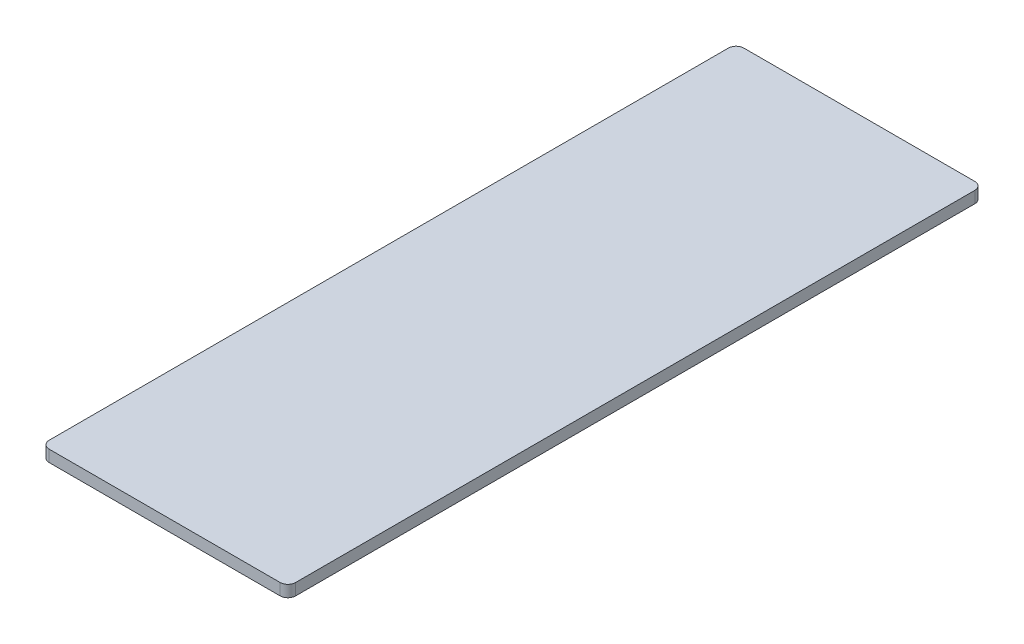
ISO-10303-21;
HEADER;
FILE_DESCRIPTION(('STEP AP214'),'2;1');
FILE_NAME('part.step','',(''),(''),'','','');
FILE_SCHEMA(('AUTOMOTIVE_DESIGN { 1 0 10303 214 1 1 1 1 }'));
ENDSEC;
DATA;
#1=APPLICATION_CONTEXT('core data for automotive mechanical design processes');
#2=APPLICATION_PROTOCOL_DEFINITION('international standard','automotive_design',2000,#1);
#3=PRODUCT_CONTEXT('',#1,'mechanical');
#4=PRODUCT('Part','Part','',(#3));
#5=PRODUCT_RELATED_PRODUCT_CATEGORY('part','',(#4));
#6=PRODUCT_DEFINITION_FORMATION('','',#4);
#7=PRODUCT_DEFINITION_CONTEXT('part definition',#1,'design');
#8=PRODUCT_DEFINITION('design','',#6,#7);
#9=PRODUCT_DEFINITION_SHAPE('','',#8);
#10=(LENGTH_UNIT() NAMED_UNIT(*) SI_UNIT(.MILLI.,.METRE.));
#11=(NAMED_UNIT(*) PLANE_ANGLE_UNIT() SI_UNIT($,.RADIAN.));
#12=(NAMED_UNIT(*) SI_UNIT($,.STERADIAN.) SOLID_ANGLE_UNIT());
#13=UNCERTAINTY_MEASURE_WITH_UNIT(LENGTH_MEASURE(1.E-05),#10,'distance_accuracy_value','');
#14=(GEOMETRIC_REPRESENTATION_CONTEXT(3) GLOBAL_UNCERTAINTY_ASSIGNED_CONTEXT((#13)) GLOBAL_UNIT_ASSIGNED_CONTEXT((#10,
#11,#12)) REPRESENTATION_CONTEXT('',''));
#15=CARTESIAN_POINT('',(0.,0.,0.));
#16=DIRECTION('',(0.,0.,1.));
#17=DIRECTION('',(1.,0.,0.));
#18=AXIS2_PLACEMENT_3D('',#15,#16,#17);
#19=CARTESIAN_POINT('',(-66.8349990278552,53.7787150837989,179.));
#20=DIRECTION('',(1.,0.,0.));
#21=DIRECTION('',(0.,0.,-1.));
#22=AXIS2_PLACEMENT_3D('',#19,#20,#21);
#23=PLANE('',#22);
#24=DIRECTION('',(0.,0.,-1.));
#25=VECTOR('',#24,1.);
#26=CARTESIAN_POINT('',(-66.8349990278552,50.7787150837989,179.));
#27=LINE('',#26,#25);
#28=CARTESIAN_POINT('',(-66.8349990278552,50.7787150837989,177.));
#29=VERTEX_POINT('',#28);
#30=CARTESIAN_POINT('',(-66.8349990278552,50.7787150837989,2.00000000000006));
#31=VERTEX_POINT('',#30);
#32=EDGE_CURVE('E117',#29,#31,#27,.T.);
#33=ORIENTED_EDGE('',*,*,#32,.F.);
#34=DIRECTION('',(0.,-1.,0.));
#35=VECTOR('',#34,1.);
#36=CARTESIAN_POINT('',(-66.8349990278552,53.7787150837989,177.));
#37=LINE('',#36,#35);
#38=CARTESIAN_POINT('',(-66.8349990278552,53.7787150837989,177.));
#39=VERTEX_POINT('',#38);
#40=EDGE_CURVE('E104',#29,#39,#37,.F.);
#41=ORIENTED_EDGE('',*,*,#40,.T.);
#42=DIRECTION('',(0.,0.,-1.));
#43=VECTOR('',#42,1.);
#44=CARTESIAN_POINT('',(-66.8349990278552,53.7787150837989,179.));
#45=LINE('',#44,#43);
#46=CARTESIAN_POINT('',(-66.8349990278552,53.7787150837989,2.00000000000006));
#47=VERTEX_POINT('',#46);
#48=EDGE_CURVE('E124',#39,#47,#45,.T.);
#49=ORIENTED_EDGE('',*,*,#48,.T.);
#50=DIRECTION('',(0.,-1.,0.));
#51=VECTOR('',#50,1.);
#52=CARTESIAN_POINT('',(-66.8349990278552,53.7787150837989,2.));
#53=LINE('',#52,#51);
#54=EDGE_CURVE('E159',#47,#31,#53,.T.);
#55=ORIENTED_EDGE('',*,*,#54,.T.);
#56=EDGE_LOOP('',(#33,#41,#49,#55));
#57=FACE_BOUND('',#56,.T.);
#58=ADVANCED_FACE('F34',(#57),#23,.F.);
#59=CARTESIAN_POINT('',(-66.8349990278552,50.7787150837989,179.));
#60=DIRECTION('',(0.,1.,0.));
#61=DIRECTION('',(0.,0.,1.));
#62=AXIS2_PLACEMENT_3D('',#59,#60,#61);
#63=PLANE('',#62);
#64=DIRECTION('',(0.,0.,-1.));
#65=VECTOR('',#64,1.);
#66=CARTESIAN_POINT('',(-3.3349990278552,50.7787150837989,179.));
#67=LINE('',#66,#65);
#68=CARTESIAN_POINT('',(-3.3349990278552,50.7787150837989,177.));
#69=VERTEX_POINT('',#68);
#70=CARTESIAN_POINT('',(-3.3349990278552,50.7787150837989,2.00000000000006));
#71=VERTEX_POINT('',#70);
#72=EDGE_CURVE('E137',#69,#71,#67,.T.);
#73=ORIENTED_EDGE('',*,*,#72,.F.);
#74=CARTESIAN_POINT('',(-5.3349990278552,50.7787150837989,177.));
#75=DIRECTION('',(0.,1.,0.));
#76=DIRECTION('',(0.,0.,1.));
#77=AXIS2_PLACEMENT_3D('',#74,#75,#76);
#78=CIRCLE('',#77,2.);
#79=CARTESIAN_POINT('',(-5.3349990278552,50.7787150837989,179.));
#80=VERTEX_POINT('',#79);
#81=EDGE_CURVE('E105',#69,#80,#78,.F.);
#82=ORIENTED_EDGE('',*,*,#81,.T.);
#83=DIRECTION('',(1.,0.,0.));
#84=VECTOR('',#83,1.);
#85=CARTESIAN_POINT('',(-66.8349990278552,50.7787150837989,179.));
#86=LINE('',#85,#84);
#87=CARTESIAN_POINT('',(-64.8349990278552,50.7787150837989,179.));
#88=VERTEX_POINT('',#87);
#89=EDGE_CURVE('E112',#88,#80,#86,.T.);
#90=ORIENTED_EDGE('',*,*,#89,.F.);
#91=CARTESIAN_POINT('',(-64.8349990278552,50.7787150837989,177.));
#92=DIRECTION('',(0.,1.,0.));
#93=DIRECTION('',(0.,0.,1.));
#94=AXIS2_PLACEMENT_3D('',#91,#92,#93);
#95=CIRCLE('',#94,2.);
#96=EDGE_CURVE('E57',#88,#29,#95,.F.);
#97=ORIENTED_EDGE('',*,*,#96,.T.);
#98=ORIENTED_EDGE('',*,*,#32,.T.);
#99=CARTESIAN_POINT('',(-64.8349990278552,50.7787150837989,2.));
#100=DIRECTION('',(0.,1.,0.));
#101=DIRECTION('',(0.,0.,1.));
#102=AXIS2_PLACEMENT_3D('',#99,#100,#101);
#103=CIRCLE('',#102,2.);
#104=CARTESIAN_POINT('',(-64.8349990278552,50.7787150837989,0.));
#105=VERTEX_POINT('',#104);
#106=EDGE_CURVE('E49',#31,#105,#103,.F.);
#107=ORIENTED_EDGE('',*,*,#106,.T.);
#108=DIRECTION('',(1.,0.,0.));
#109=VECTOR('',#108,1.);
#110=CARTESIAN_POINT('',(-66.8349990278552,50.7787150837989,0.));
#111=LINE('',#110,#109);
#112=CARTESIAN_POINT('',(-5.3349990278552,50.7787150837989,0.));
#113=VERTEX_POINT('',#112);
#114=EDGE_CURVE('E127',#105,#113,#111,.T.);
#115=ORIENTED_EDGE('',*,*,#114,.T.);
#116=CARTESIAN_POINT('',(-5.3349990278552,50.7787150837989,2.));
#117=DIRECTION('',(0.,1.,0.));
#118=DIRECTION('',(0.,0.,1.));
#119=AXIS2_PLACEMENT_3D('',#116,#117,#118);
#120=CIRCLE('',#119,2.);
#121=EDGE_CURVE('E155',#113,#71,#120,.F.);
#122=ORIENTED_EDGE('',*,*,#121,.T.);
#123=EDGE_LOOP('',(#73,#82,#90,#97,#98,#107,#115,#122));
#124=FACE_BOUND('',#123,.T.);
#125=ADVANCED_FACE('F120',(#124),#63,.F.);
#126=CARTESIAN_POINT('',(-3.3349990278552,53.7787150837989,179.));
#127=DIRECTION('',(-1.,0.,0.));
#128=DIRECTION('',(0.,0.,1.));
#129=AXIS2_PLACEMENT_3D('',#126,#127,#128);
#130=PLANE('',#129);
#131=DIRECTION('',(0.,0.,-1.));
#132=VECTOR('',#131,1.);
#133=CARTESIAN_POINT('',(-3.3349990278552,53.7787150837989,179.));
#134=LINE('',#133,#132);
#135=CARTESIAN_POINT('',(-3.3349990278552,53.7787150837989,177.));
#136=VERTEX_POINT('',#135);
#137=CARTESIAN_POINT('',(-3.3349990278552,53.7787150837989,2.00000000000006));
#138=VERTEX_POINT('',#137);
#139=EDGE_CURVE('E134',#136,#138,#134,.T.);
#140=ORIENTED_EDGE('',*,*,#139,.F.);
#141=DIRECTION('',(0.,1.,0.));
#142=VECTOR('',#141,1.);
#143=CARTESIAN_POINT('',(-3.3349990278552,50.7787150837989,177.));
#144=LINE('',#143,#142);
#145=EDGE_CURVE('E153',#136,#69,#144,.F.);
#146=ORIENTED_EDGE('',*,*,#145,.T.);
#147=ORIENTED_EDGE('',*,*,#72,.T.);
#148=DIRECTION('',(0.,1.,0.));
#149=VECTOR('',#148,1.);
#150=CARTESIAN_POINT('',(-3.3349990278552,53.7787150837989,2.));
#151=LINE('',#150,#149);
#152=EDGE_CURVE('E150',#71,#138,#151,.T.);
#153=ORIENTED_EDGE('',*,*,#152,.T.);
#154=EDGE_LOOP('',(#140,#146,#147,#153));
#155=FACE_BOUND('',#154,.T.);
#156=ADVANCED_FACE('F171',(#155),#130,.F.);
#157=CARTESIAN_POINT('',(-66.8349990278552,53.7787150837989,179.));
#158=DIRECTION('',(0.,-1.,0.));
#159=DIRECTION('',(0.,0.,-1.));
#160=AXIS2_PLACEMENT_3D('',#157,#158,#159);
#161=PLANE('',#160);
#162=DIRECTION('',(-1.,0.,0.));
#163=VECTOR('',#162,1.);
#164=CARTESIAN_POINT('',(-66.8349990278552,53.7787150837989,179.));
#165=LINE('',#164,#163);
#166=CARTESIAN_POINT('',(-5.3349990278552,53.7787150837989,179.));
#167=VERTEX_POINT('',#166);
#168=CARTESIAN_POINT('',(-64.8349990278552,53.7787150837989,179.));
#169=VERTEX_POINT('',#168);
#170=EDGE_CURVE('E115',#167,#169,#165,.T.);
#171=ORIENTED_EDGE('',*,*,#170,.F.);
#172=CARTESIAN_POINT('',(-5.3349990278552,53.7787150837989,177.));
#173=DIRECTION('',(0.,-1.,0.));
#174=DIRECTION('',(0.,0.,-1.));
#175=AXIS2_PLACEMENT_3D('',#172,#173,#174);
#176=CIRCLE('',#175,2.);
#177=EDGE_CURVE('E148',#167,#136,#176,.F.);
#178=ORIENTED_EDGE('',*,*,#177,.T.);
#179=ORIENTED_EDGE('',*,*,#139,.T.);
#180=CARTESIAN_POINT('',(-5.3349990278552,53.7787150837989,2.));
#181=DIRECTION('',(0.,-1.,0.));
#182=DIRECTION('',(0.,0.,-1.));
#183=AXIS2_PLACEMENT_3D('',#180,#181,#182);
#184=CIRCLE('',#183,2.);
#185=CARTESIAN_POINT('',(-5.3349990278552,53.7787150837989,0.));
#186=VERTEX_POINT('',#185);
#187=EDGE_CURVE('E142',#138,#186,#184,.F.);
#188=ORIENTED_EDGE('',*,*,#187,.T.);
#189=DIRECTION('',(-1.,0.,0.));
#190=VECTOR('',#189,1.);
#191=CARTESIAN_POINT('',(-66.8349990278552,53.7787150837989,0.));
#192=LINE('',#191,#190);
#193=CARTESIAN_POINT('',(-64.8349990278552,53.7787150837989,0.));
#194=VERTEX_POINT('',#193);
#195=EDGE_CURVE('E122',#186,#194,#192,.T.);
#196=ORIENTED_EDGE('',*,*,#195,.T.);
#197=CARTESIAN_POINT('',(-64.8349990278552,53.7787150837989,2.));
#198=DIRECTION('',(0.,-1.,0.));
#199=DIRECTION('',(0.,0.,-1.));
#200=AXIS2_PLACEMENT_3D('',#197,#198,#199);
#201=CIRCLE('',#200,2.);
#202=EDGE_CURVE('E144',#194,#47,#201,.F.);
#203=ORIENTED_EDGE('',*,*,#202,.T.);
#204=ORIENTED_EDGE('',*,*,#48,.F.);
#205=CARTESIAN_POINT('',(-64.8349990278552,53.7787150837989,177.));
#206=DIRECTION('',(0.,-1.,0.));
#207=DIRECTION('',(0.,0.,-1.));
#208=AXIS2_PLACEMENT_3D('',#205,#206,#207);
#209=CIRCLE('',#208,2.);
#210=EDGE_CURVE('E146',#39,#169,#209,.F.);
#211=ORIENTED_EDGE('',*,*,#210,.T.);
#212=EDGE_LOOP('',(#171,#178,#179,#188,#196,#203,#204,#211));
#213=FACE_BOUND('',#212,.T.);
#214=ADVANCED_FACE('F174',(#213),#161,.F.);
#215=CARTESIAN_POINT('',(-66.8349990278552,50.7787150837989,179.));
#216=DIRECTION('',(0.,0.,1.));
#217=DIRECTION('',(1.,0.,0.));
#218=AXIS2_PLACEMENT_3D('',#215,#216,#217);
#219=PLANE('',#218);
#220=ORIENTED_EDGE('',*,*,#89,.T.);
#221=DIRECTION('',(0.,1.,0.));
#222=VECTOR('',#221,1.);
#223=CARTESIAN_POINT('',(-5.3349990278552,53.7787150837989,179.));
#224=LINE('',#223,#222);
#225=EDGE_CURVE('E116',#80,#167,#224,.T.);
#226=ORIENTED_EDGE('',*,*,#225,.T.);
#227=ORIENTED_EDGE('',*,*,#170,.T.);
#228=DIRECTION('',(0.,-1.,0.));
#229=VECTOR('',#228,1.);
#230=CARTESIAN_POINT('',(-64.8349990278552,50.7787150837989,179.));
#231=LINE('',#230,#229);
#232=EDGE_CURVE('E103',#169,#88,#231,.T.);
#233=ORIENTED_EDGE('',*,*,#232,.T.);
#234=EDGE_LOOP('',(#220,#226,#227,#233));
#235=FACE_BOUND('',#234,.T.);
#236=ADVANCED_FACE('F110',(#235),#219,.T.);
#237=CARTESIAN_POINT('',(-66.8349990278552,50.7787150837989,0.));
#238=DIRECTION('',(0.,0.,1.));
#239=DIRECTION('',(1.,0.,0.));
#240=AXIS2_PLACEMENT_3D('',#237,#238,#239);
#241=PLANE('',#240);
#242=ORIENTED_EDGE('',*,*,#114,.F.);
#243=DIRECTION('',(0.,-1.,0.));
#244=VECTOR('',#243,1.);
#245=CARTESIAN_POINT('',(-64.8349990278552,50.7787150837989,0.));
#246=LINE('',#245,#244);
#247=EDGE_CURVE('E11',#105,#194,#246,.F.);
#248=ORIENTED_EDGE('',*,*,#247,.T.);
#249=ORIENTED_EDGE('',*,*,#195,.F.);
#250=DIRECTION('',(0.,1.,0.));
#251=VECTOR('',#250,1.);
#252=CARTESIAN_POINT('',(-5.3349990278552,50.7787150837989,0.));
#253=LINE('',#252,#251);
#254=EDGE_CURVE('E42',#186,#113,#253,.F.);
#255=ORIENTED_EDGE('',*,*,#254,.T.);
#256=EDGE_LOOP('',(#242,#248,#249,#255));
#257=FACE_BOUND('',#256,.T.);
#258=ADVANCED_FACE('F165',(#257),#241,.F.);
#259=CARTESIAN_POINT('',(-5.3349990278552,50.7787150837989,177.));
#260=DIRECTION('',(0.,-1.,0.));
#261=DIRECTION('',(0.,0.,-1.));
#262=AXIS2_PLACEMENT_3D('',#259,#260,#261);
#263=CYLINDRICAL_SURFACE('',#262,2.);
#264=ORIENTED_EDGE('',*,*,#81,.F.);
#265=ORIENTED_EDGE('',*,*,#145,.F.);
#266=ORIENTED_EDGE('',*,*,#177,.F.);
#267=ORIENTED_EDGE('',*,*,#225,.F.);
#268=EDGE_LOOP('',(#264,#265,#266,#267));
#269=FACE_BOUND('',#268,.T.);
#270=ADVANCED_FACE('F176',(#269),#263,.T.);
#271=CARTESIAN_POINT('',(-64.8349990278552,50.7787150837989,177.));
#272=DIRECTION('',(0.,1.,0.));
#273=DIRECTION('',(0.,0.,1.));
#274=AXIS2_PLACEMENT_3D('',#271,#272,#273);
#275=CYLINDRICAL_SURFACE('',#274,2.);
#276=ORIENTED_EDGE('',*,*,#210,.F.);
#277=ORIENTED_EDGE('',*,*,#40,.F.);
#278=ORIENTED_EDGE('',*,*,#96,.F.);
#279=ORIENTED_EDGE('',*,*,#232,.F.);
#280=EDGE_LOOP('',(#276,#277,#278,#279));
#281=FACE_BOUND('',#280,.T.);
#282=ADVANCED_FACE('F102',(#281),#275,.T.);
#283=CARTESIAN_POINT('',(-64.8349990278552,53.7787150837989,2.));
#284=DIRECTION('',(0.,-1.,0.));
#285=DIRECTION('',(0.,0.,-1.));
#286=AXIS2_PLACEMENT_3D('',#283,#284,#285);
#287=CYLINDRICAL_SURFACE('',#286,2.);
#288=ORIENTED_EDGE('',*,*,#202,.F.);
#289=ORIENTED_EDGE('',*,*,#247,.F.);
#290=ORIENTED_EDGE('',*,*,#106,.F.);
#291=ORIENTED_EDGE('',*,*,#54,.F.);
#292=EDGE_LOOP('',(#288,#289,#290,#291));
#293=FACE_BOUND('',#292,.T.);
#294=ADVANCED_FACE('F183',(#293),#287,.T.);
#295=CARTESIAN_POINT('',(-5.3349990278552,53.7787150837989,2.));
#296=DIRECTION('',(0.,1.,0.));
#297=DIRECTION('',(0.,0.,1.));
#298=AXIS2_PLACEMENT_3D('',#295,#296,#297);
#299=CYLINDRICAL_SURFACE('',#298,2.);
#300=ORIENTED_EDGE('',*,*,#121,.F.);
#301=ORIENTED_EDGE('',*,*,#254,.F.);
#302=ORIENTED_EDGE('',*,*,#187,.F.);
#303=ORIENTED_EDGE('',*,*,#152,.F.);
#304=EDGE_LOOP('',(#300,#301,#302,#303));
#305=FACE_BOUND('',#304,.T.);
#306=ADVANCED_FACE('F36',(#305),#299,.T.);
#307=CLOSED_SHELL('',(#58,#125,#156,#214,#236,#258,#270,#282,#294,#306));
#308=MANIFOLD_SOLID_BREP('B2',#307);
#309=ADVANCED_BREP_SHAPE_REPRESENTATION('',(#18,#308),#14);
#310=SHAPE_DEFINITION_REPRESENTATION(#9,#309);
ENDSEC;
END-ISO-10303-21;
